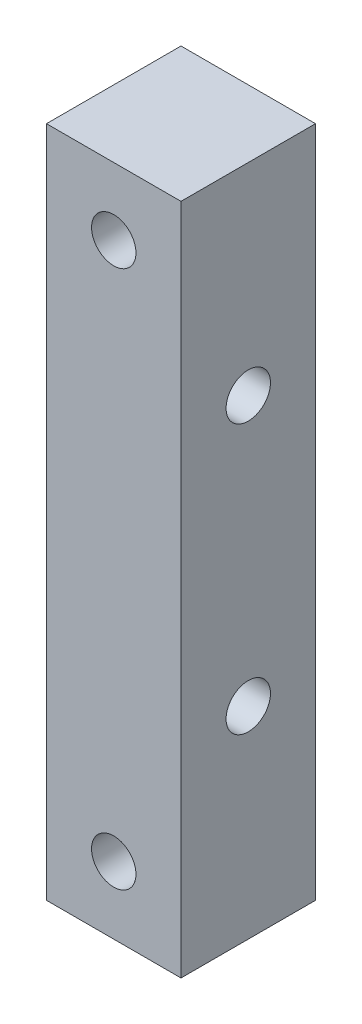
ISO-10303-21;
HEADER;
FILE_DESCRIPTION(('STEP AP214'),'2;1');
FILE_NAME('part.step','',(''),(''),'','','');
FILE_SCHEMA(('AUTOMOTIVE_DESIGN { 1 0 10303 214 1 1 1 1 }'));
ENDSEC;
DATA;
#1=APPLICATION_CONTEXT('core data for automotive mechanical design processes');
#2=APPLICATION_PROTOCOL_DEFINITION('international standard','automotive_design',2000,#1);
#3=PRODUCT_CONTEXT('',#1,'mechanical');
#4=PRODUCT('Part','Part','',(#3));
#5=PRODUCT_RELATED_PRODUCT_CATEGORY('part','',(#4));
#6=PRODUCT_DEFINITION_FORMATION('','',#4);
#7=PRODUCT_DEFINITION_CONTEXT('part definition',#1,'design');
#8=PRODUCT_DEFINITION('design','',#6,#7);
#9=PRODUCT_DEFINITION_SHAPE('','',#8);
#10=(LENGTH_UNIT() NAMED_UNIT(*) SI_UNIT(.MILLI.,.METRE.));
#11=(NAMED_UNIT(*) PLANE_ANGLE_UNIT() SI_UNIT($,.RADIAN.));
#12=(NAMED_UNIT(*) SI_UNIT($,.STERADIAN.) SOLID_ANGLE_UNIT());
#13=UNCERTAINTY_MEASURE_WITH_UNIT(LENGTH_MEASURE(1.E-05),#10,'distance_accuracy_value','');
#14=(GEOMETRIC_REPRESENTATION_CONTEXT(3) GLOBAL_UNCERTAINTY_ASSIGNED_CONTEXT((#13)) GLOBAL_UNIT_ASSIGNED_CONTEXT((#10,
#11,#12)) REPRESENTATION_CONTEXT('',''));
#15=CARTESIAN_POINT('',(0.,0.,0.));
#16=DIRECTION('',(0.,0.,1.));
#17=DIRECTION('',(1.,0.,0.));
#18=AXIS2_PLACEMENT_3D('',#15,#16,#17);
#19=CARTESIAN_POINT('',(5.,50.,-5.));
#20=DIRECTION('',(-1.,0.,0.));
#21=DIRECTION('',(0.,0.,1.));
#22=AXIS2_PLACEMENT_3D('',#19,#20,#21);
#23=PLANE('',#22);
#24=CARTESIAN_POINT('',(5.,35.,0.));
#25=DIRECTION('',(1.,0.,0.));
#26=DIRECTION('',(0.,0.,-1.));
#27=AXIS2_PLACEMENT_3D('',#24,#25,#26);
#28=CIRCLE('',#27,1.64999999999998);
#29=CARTESIAN_POINT('',(5.,35.,-1.64999999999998));
#30=VERTEX_POINT('',#29);
#31=EDGE_CURVE('E138',#30,#30,#28,.T.);
#32=ORIENTED_EDGE('',*,*,#31,.F.);
#33=EDGE_LOOP('',(#32));
#34=FACE_BOUND('',#33,.T.);
#35=CARTESIAN_POINT('',(5.,15.,0.));
#36=DIRECTION('',(1.,0.,0.));
#37=DIRECTION('',(0.,0.,-1.));
#38=AXIS2_PLACEMENT_3D('',#35,#36,#37);
#39=CIRCLE('',#38,1.64999999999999);
#40=CARTESIAN_POINT('',(5.,15.,-1.64999999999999));
#41=VERTEX_POINT('',#40);
#42=EDGE_CURVE('E132',#41,#41,#39,.T.);
#43=ORIENTED_EDGE('',*,*,#42,.F.);
#44=EDGE_LOOP('',(#43));
#45=FACE_BOUND('',#44,.T.);
#46=DIRECTION('',(0.,0.,-1.));
#47=VECTOR('',#46,1.);
#48=CARTESIAN_POINT('',(5.,0.,-5.));
#49=LINE('',#48,#47);
#50=CARTESIAN_POINT('',(5.,0.,5.));
#51=VERTEX_POINT('',#50);
#52=CARTESIAN_POINT('',(5.,0.,-5.));
#53=VERTEX_POINT('',#52);
#54=EDGE_CURVE('E104',#51,#53,#49,.T.);
#55=ORIENTED_EDGE('',*,*,#54,.T.);
#56=DIRECTION('',(0.,-1.,0.));
#57=VECTOR('',#56,1.);
#58=CARTESIAN_POINT('',(5.,50.,-5.));
#59=LINE('',#58,#57);
#60=CARTESIAN_POINT('',(5.,50.,-5.));
#61=VERTEX_POINT('',#60);
#62=EDGE_CURVE('E11',#61,#53,#59,.T.);
#63=ORIENTED_EDGE('',*,*,#62,.F.);
#64=DIRECTION('',(0.,0.,-1.));
#65=VECTOR('',#64,1.);
#66=CARTESIAN_POINT('',(5.,50.,-5.));
#67=LINE('',#66,#65);
#68=CARTESIAN_POINT('',(5.,50.,5.));
#69=VERTEX_POINT('',#68);
#70=EDGE_CURVE('E92',#69,#61,#67,.T.);
#71=ORIENTED_EDGE('',*,*,#70,.F.);
#72=DIRECTION('',(0.,-1.,0.));
#73=VECTOR('',#72,1.);
#74=CARTESIAN_POINT('',(5.,50.,5.));
#75=LINE('',#74,#73);
#76=EDGE_CURVE('E100',#69,#51,#75,.T.);
#77=ORIENTED_EDGE('',*,*,#76,.T.);
#78=EDGE_LOOP('',(#55,#63,#71,#77));
#79=FACE_BOUND('',#78,.T.);
#80=ADVANCED_FACE('F41',(#34,#45,#79),#23,.F.);
#81=CARTESIAN_POINT('',(-5.,50.,-5.));
#82=DIRECTION('',(0.,0.,1.));
#83=DIRECTION('',(1.,0.,0.));
#84=AXIS2_PLACEMENT_3D('',#81,#82,#83);
#85=PLANE('',#84);
#86=CARTESIAN_POINT('',(0.,45.,-4.99999999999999));
#87=DIRECTION('',(0.,0.,1.));
#88=DIRECTION('',(1.,0.,0.));
#89=AXIS2_PLACEMENT_3D('',#86,#87,#88);
#90=CIRCLE('',#89,1.64999999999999);
#91=CARTESIAN_POINT('',(1.64999999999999,45.,-4.99999999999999));
#92=VERTEX_POINT('',#91);
#93=EDGE_CURVE('E123',#92,#92,#90,.T.);
#94=ORIENTED_EDGE('',*,*,#93,.T.);
#95=EDGE_LOOP('',(#94));
#96=FACE_BOUND('',#95,.T.);
#97=CARTESIAN_POINT('',(0.,5.,-4.99999999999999));
#98=DIRECTION('',(0.,0.,1.));
#99=DIRECTION('',(1.,0.,0.));
#100=AXIS2_PLACEMENT_3D('',#97,#98,#99);
#101=CIRCLE('',#100,1.64999999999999);
#102=CARTESIAN_POINT('',(1.64999999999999,5.,-4.99999999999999));
#103=VERTEX_POINT('',#102);
#104=EDGE_CURVE('E107',#103,#103,#101,.T.);
#105=ORIENTED_EDGE('',*,*,#104,.T.);
#106=EDGE_LOOP('',(#105));
#107=FACE_BOUND('',#106,.T.);
#108=DIRECTION('',(-1.,0.,0.));
#109=VECTOR('',#108,1.);
#110=CARTESIAN_POINT('',(-5.,0.,-5.));
#111=LINE('',#110,#109);
#112=CARTESIAN_POINT('',(-5.,0.,-5.));
#113=VERTEX_POINT('',#112);
#114=EDGE_CURVE('E96',#53,#113,#111,.T.);
#115=ORIENTED_EDGE('',*,*,#114,.T.);
#116=DIRECTION('',(0.,-1.,0.));
#117=VECTOR('',#116,1.);
#118=CARTESIAN_POINT('',(-5.,50.,-5.));
#119=LINE('',#118,#117);
#120=CARTESIAN_POINT('',(-5.,50.,-5.));
#121=VERTEX_POINT('',#120);
#122=EDGE_CURVE('E49',#121,#113,#119,.T.);
#123=ORIENTED_EDGE('',*,*,#122,.F.);
#124=DIRECTION('',(-1.,0.,0.));
#125=VECTOR('',#124,1.);
#126=CARTESIAN_POINT('',(-5.,50.,-5.));
#127=LINE('',#126,#125);
#128=EDGE_CURVE('E87',#61,#121,#127,.T.);
#129=ORIENTED_EDGE('',*,*,#128,.F.);
#130=ORIENTED_EDGE('',*,*,#62,.T.);
#131=EDGE_LOOP('',(#115,#123,#129,#130));
#132=FACE_BOUND('',#131,.T.);
#133=ADVANCED_FACE('F95',(#96,#107,#132),#85,.F.);
#134=CARTESIAN_POINT('',(-5.,50.,-5.));
#135=DIRECTION('',(1.,0.,0.));
#136=DIRECTION('',(0.,0.,-1.));
#137=AXIS2_PLACEMENT_3D('',#134,#135,#136);
#138=PLANE('',#137);
#139=CARTESIAN_POINT('',(-5.,35.,0.));
#140=DIRECTION('',(1.,0.,0.));
#141=DIRECTION('',(0.,0.,-1.));
#142=AXIS2_PLACEMENT_3D('',#139,#140,#141);
#143=CIRCLE('',#142,1.64999999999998);
#144=CARTESIAN_POINT('',(-5.,35.,-1.64999999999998));
#145=VERTEX_POINT('',#144);
#146=EDGE_CURVE('E135',#145,#145,#143,.T.);
#147=ORIENTED_EDGE('',*,*,#146,.T.);
#148=EDGE_LOOP('',(#147));
#149=FACE_BOUND('',#148,.T.);
#150=CARTESIAN_POINT('',(-5.,15.,0.));
#151=DIRECTION('',(1.,0.,0.));
#152=DIRECTION('',(0.,0.,-1.));
#153=AXIS2_PLACEMENT_3D('',#150,#151,#152);
#154=CIRCLE('',#153,1.64999999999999);
#155=CARTESIAN_POINT('',(-5.,15.,-1.64999999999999));
#156=VERTEX_POINT('',#155);
#157=EDGE_CURVE('E129',#156,#156,#154,.T.);
#158=ORIENTED_EDGE('',*,*,#157,.T.);
#159=EDGE_LOOP('',(#158));
#160=FACE_BOUND('',#159,.T.);
#161=DIRECTION('',(0.,0.,1.));
#162=VECTOR('',#161,1.);
#163=CARTESIAN_POINT('',(-5.,0.,-5.));
#164=LINE('',#163,#162);
#165=CARTESIAN_POINT('',(-5.,0.,5.));
#166=VERTEX_POINT('',#165);
#167=EDGE_CURVE('E74',#113,#166,#164,.T.);
#168=ORIENTED_EDGE('',*,*,#167,.T.);
#169=DIRECTION('',(0.,-1.,0.));
#170=VECTOR('',#169,1.);
#171=CARTESIAN_POINT('',(-5.,50.,5.));
#172=LINE('',#171,#170);
#173=CARTESIAN_POINT('',(-5.,50.,5.));
#174=VERTEX_POINT('',#173);
#175=EDGE_CURVE('E97',#174,#166,#172,.T.);
#176=ORIENTED_EDGE('',*,*,#175,.F.);
#177=DIRECTION('',(0.,0.,1.));
#178=VECTOR('',#177,1.);
#179=CARTESIAN_POINT('',(-5.,50.,-5.));
#180=LINE('',#179,#178);
#181=EDGE_CURVE('E90',#121,#174,#180,.T.);
#182=ORIENTED_EDGE('',*,*,#181,.F.);
#183=ORIENTED_EDGE('',*,*,#122,.T.);
#184=EDGE_LOOP('',(#168,#176,#182,#183));
#185=FACE_BOUND('',#184,.T.);
#186=ADVANCED_FACE('F98',(#149,#160,#185),#138,.F.);
#187=CARTESIAN_POINT('',(-5.,50.,5.));
#188=DIRECTION('',(0.,0.,-1.));
#189=DIRECTION('',(-1.,0.,0.));
#190=AXIS2_PLACEMENT_3D('',#187,#188,#189);
#191=PLANE('',#190);
#192=CARTESIAN_POINT('',(0.,45.,5.));
#193=DIRECTION('',(0.,0.,1.));
#194=DIRECTION('',(1.,0.,0.));
#195=AXIS2_PLACEMENT_3D('',#192,#193,#194);
#196=CIRCLE('',#195,1.64999999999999);
#197=CARTESIAN_POINT('',(1.64999999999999,45.,5.));
#198=VERTEX_POINT('',#197);
#199=EDGE_CURVE('E126',#198,#198,#196,.T.);
#200=ORIENTED_EDGE('',*,*,#199,.F.);
#201=EDGE_LOOP('',(#200));
#202=FACE_BOUND('',#201,.T.);
#203=CARTESIAN_POINT('',(0.,5.,5.));
#204=DIRECTION('',(0.,0.,1.));
#205=DIRECTION('',(1.,0.,0.));
#206=AXIS2_PLACEMENT_3D('',#203,#204,#205);
#207=CIRCLE('',#206,1.64999999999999);
#208=CARTESIAN_POINT('',(1.64999999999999,5.,5.));
#209=VERTEX_POINT('',#208);
#210=EDGE_CURVE('E120',#209,#209,#207,.T.);
#211=ORIENTED_EDGE('',*,*,#210,.F.);
#212=EDGE_LOOP('',(#211));
#213=FACE_BOUND('',#212,.T.);
#214=DIRECTION('',(1.,0.,0.));
#215=VECTOR('',#214,1.);
#216=CARTESIAN_POINT('',(-5.,0.,5.));
#217=LINE('',#216,#215);
#218=EDGE_CURVE('E80',#166,#51,#217,.T.);
#219=ORIENTED_EDGE('',*,*,#218,.T.);
#220=ORIENTED_EDGE('',*,*,#76,.F.);
#221=DIRECTION('',(1.,0.,0.));
#222=VECTOR('',#221,1.);
#223=CARTESIAN_POINT('',(-5.,50.,5.));
#224=LINE('',#223,#222);
#225=EDGE_CURVE('E57',#174,#69,#224,.T.);
#226=ORIENTED_EDGE('',*,*,#225,.F.);
#227=ORIENTED_EDGE('',*,*,#175,.T.);
#228=EDGE_LOOP('',(#219,#220,#226,#227));
#229=FACE_BOUND('',#228,.T.);
#230=ADVANCED_FACE('F112',(#202,#213,#229),#191,.F.);
#231=CARTESIAN_POINT('',(0.,50.,0.));
#232=DIRECTION('',(0.,1.,0.));
#233=DIRECTION('',(0.,0.,1.));
#234=AXIS2_PLACEMENT_3D('',#231,#232,#233);
#235=PLANE('',#234);
#236=ORIENTED_EDGE('',*,*,#70,.T.);
#237=ORIENTED_EDGE('',*,*,#128,.T.);
#238=ORIENTED_EDGE('',*,*,#181,.T.);
#239=ORIENTED_EDGE('',*,*,#225,.T.);
#240=EDGE_LOOP('',(#236,#237,#238,#239));
#241=FACE_BOUND('',#240,.T.);
#242=ADVANCED_FACE('F88',(#241),#235,.T.);
#243=CARTESIAN_POINT('',(0.,0.,0.));
#244=DIRECTION('',(0.,1.,0.));
#245=DIRECTION('',(0.,0.,1.));
#246=AXIS2_PLACEMENT_3D('',#243,#244,#245);
#247=PLANE('',#246);
#248=ORIENTED_EDGE('',*,*,#54,.F.);
#249=ORIENTED_EDGE('',*,*,#218,.F.);
#250=ORIENTED_EDGE('',*,*,#167,.F.);
#251=ORIENTED_EDGE('',*,*,#114,.F.);
#252=EDGE_LOOP('',(#248,#249,#250,#251));
#253=FACE_BOUND('',#252,.T.);
#254=ADVANCED_FACE('F115',(#253),#247,.F.);
#255=CARTESIAN_POINT('',(0.,5.,5.));
#256=DIRECTION('',(0.,0.,1.));
#257=DIRECTION('',(1.,0.,0.));
#258=AXIS2_PLACEMENT_3D('',#255,#256,#257);
#259=CYLINDRICAL_SURFACE('',#258,1.64999999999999);
#260=ORIENTED_EDGE('',*,*,#104,.F.);
#261=EDGE_LOOP('',(#260));
#262=FACE_BOUND('',#261,.T.);
#263=ORIENTED_EDGE('',*,*,#210,.T.);
#264=EDGE_LOOP('',(#263));
#265=FACE_BOUND('',#264,.T.);
#266=ADVANCED_FACE('F159',(#262,#265),#259,.F.);
#267=CARTESIAN_POINT('',(0.,45.,5.));
#268=DIRECTION('',(0.,0.,1.));
#269=DIRECTION('',(1.,0.,0.));
#270=AXIS2_PLACEMENT_3D('',#267,#268,#269);
#271=CYLINDRICAL_SURFACE('',#270,1.64999999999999);
#272=ORIENTED_EDGE('',*,*,#93,.F.);
#273=EDGE_LOOP('',(#272));
#274=FACE_BOUND('',#273,.T.);
#275=ORIENTED_EDGE('',*,*,#199,.T.);
#276=EDGE_LOOP('',(#275));
#277=FACE_BOUND('',#276,.T.);
#278=ADVANCED_FACE('F150',(#274,#277),#271,.F.);
#279=CARTESIAN_POINT('',(5.,15.,0.));
#280=DIRECTION('',(1.,0.,0.));
#281=DIRECTION('',(0.,0.,-1.));
#282=AXIS2_PLACEMENT_3D('',#279,#280,#281);
#283=CYLINDRICAL_SURFACE('',#282,1.64999999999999);
#284=ORIENTED_EDGE('',*,*,#157,.F.);
#285=EDGE_LOOP('',(#284));
#286=FACE_BOUND('',#285,.T.);
#287=ORIENTED_EDGE('',*,*,#42,.T.);
#288=EDGE_LOOP('',(#287));
#289=FACE_BOUND('',#288,.T.);
#290=ADVANCED_FACE('F148',(#286,#289),#283,.F.);
#291=CARTESIAN_POINT('',(5.,35.,0.));
#292=DIRECTION('',(1.,0.,0.));
#293=DIRECTION('',(0.,0.,-1.));
#294=AXIS2_PLACEMENT_3D('',#291,#292,#293);
#295=CYLINDRICAL_SURFACE('',#294,1.64999999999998);
#296=ORIENTED_EDGE('',*,*,#146,.F.);
#297=EDGE_LOOP('',(#296));
#298=FACE_BOUND('',#297,.T.);
#299=ORIENTED_EDGE('',*,*,#31,.T.);
#300=EDGE_LOOP('',(#299));
#301=FACE_BOUND('',#300,.T.);
#302=ADVANCED_FACE('F142',(#298,#301),#295,.F.);
#303=CLOSED_SHELL('',(#80,#133,#186,#230,#242,#254,#266,#278,#290,#302));
#304=MANIFOLD_SOLID_BREP('B2',#303);
#305=ADVANCED_BREP_SHAPE_REPRESENTATION('',(#18,#304),#14);
#306=SHAPE_DEFINITION_REPRESENTATION(#9,#305);
ENDSEC;
END-ISO-10303-21;
